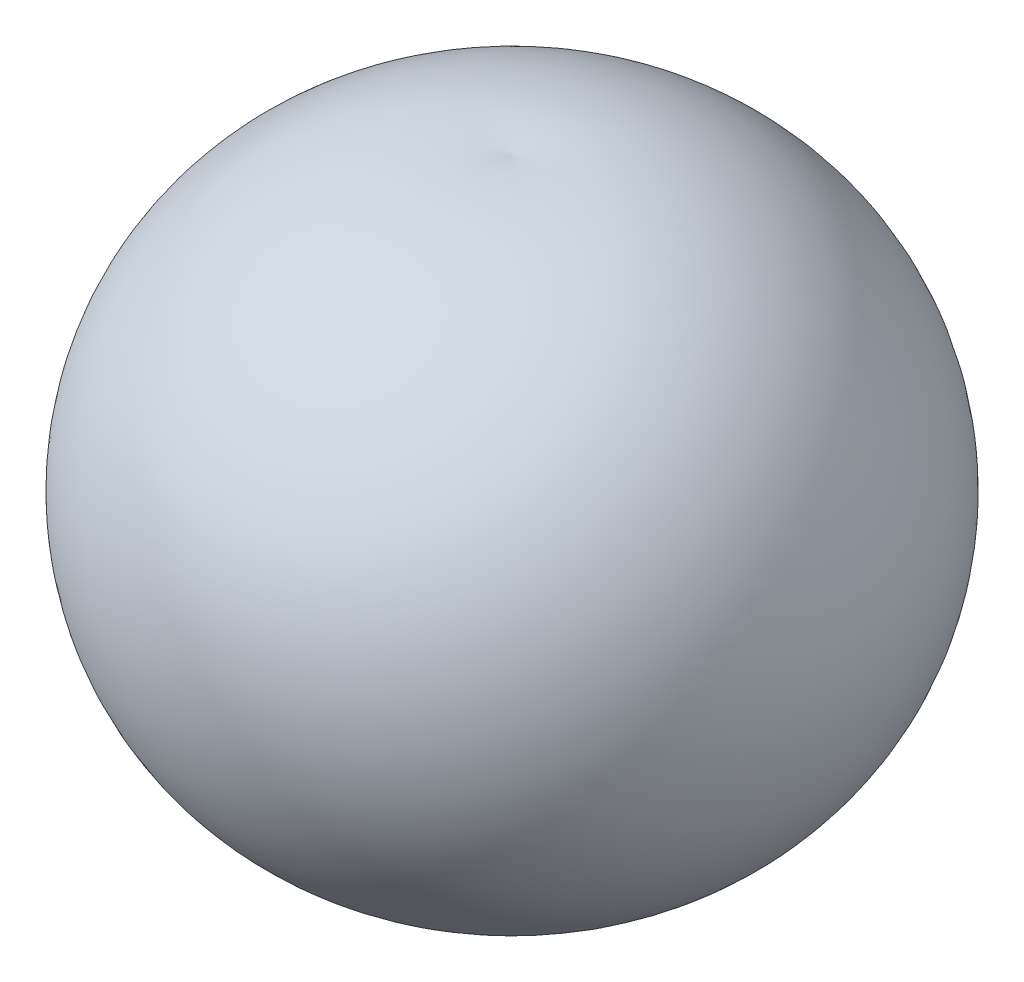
from build123d import *


with BuildPart() as part:
    # Sketch 1 → Revolve 2 (revolve)
    with BuildSketch(Plane.XY):
        with BuildLine():
            Line((0, -899.839052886), (0, 59.885336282))
            ThreePointArc((0, 59.885336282), (498.369688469, 163.666214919), (501.292440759, 672.718544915))
            ThreePointArc((501.292440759, 672.718544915), (323.657766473, 1049.645692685), (0, 1312.083880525))
            Line((0, 1312.083880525), (0, 1944.542340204))
            ThreePointArc((0, 1944.542340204), (1641.709829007, 906.262091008), (952.863, -909.977729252))
            ThreePointArc((952.863, -909.977729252), (475.044228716, -1035.288277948), (0, -899.839052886))
        make_face()
    revolve(axis=Axis((0, 2129.616582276, 0), (0, -1, 0)))


solid = part.part
